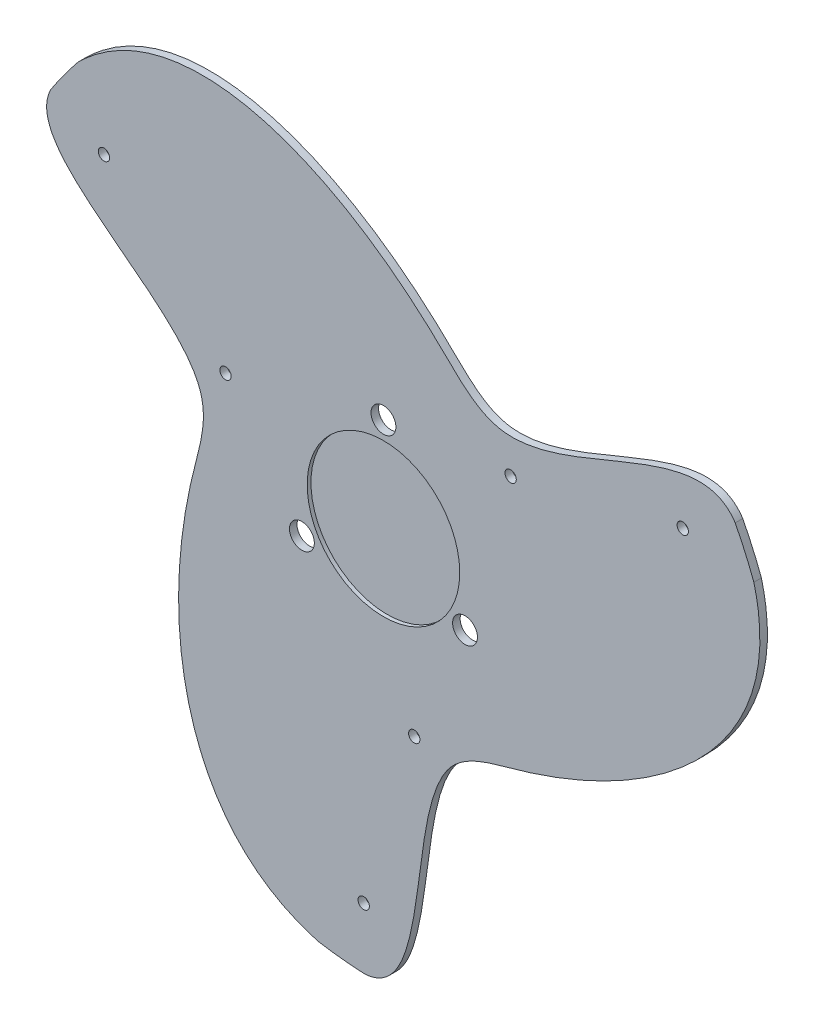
ISO-10303-21;
HEADER;
FILE_DESCRIPTION(('STEP AP214'),'2;1');
FILE_NAME('part.step','',(''),(''),'','','');
FILE_SCHEMA(('AUTOMOTIVE_DESIGN { 1 0 10303 214 1 1 1 1 }'));
ENDSEC;
DATA;
#1=APPLICATION_CONTEXT('core data for automotive mechanical design processes');
#2=APPLICATION_PROTOCOL_DEFINITION('international standard','automotive_design',2000,#1);
#3=PRODUCT_CONTEXT('',#1,'mechanical');
#4=PRODUCT('Part','Part','',(#3));
#5=PRODUCT_RELATED_PRODUCT_CATEGORY('part','',(#4));
#6=PRODUCT_DEFINITION_FORMATION('','',#4);
#7=PRODUCT_DEFINITION_CONTEXT('part definition',#1,'design');
#8=PRODUCT_DEFINITION('design','',#6,#7);
#9=PRODUCT_DEFINITION_SHAPE('','',#8);
#10=(LENGTH_UNIT() NAMED_UNIT(*) SI_UNIT(.MILLI.,.METRE.));
#11=(NAMED_UNIT(*) PLANE_ANGLE_UNIT() SI_UNIT($,.RADIAN.));
#12=(NAMED_UNIT(*) SI_UNIT($,.STERADIAN.) SOLID_ANGLE_UNIT());
#13=UNCERTAINTY_MEASURE_WITH_UNIT(LENGTH_MEASURE(1.E-05),#10,'distance_accuracy_value','');
#14=(GEOMETRIC_REPRESENTATION_CONTEXT(3) GLOBAL_UNCERTAINTY_ASSIGNED_CONTEXT((#13)) GLOBAL_UNIT_ASSIGNED_CONTEXT((#10,
#11,#12)) REPRESENTATION_CONTEXT('',''));
#15=CARTESIAN_POINT('',(0.,0.,0.));
#16=DIRECTION('',(0.,0.,1.));
#17=DIRECTION('',(1.,0.,0.));
#18=AXIS2_PLACEMENT_3D('',#15,#16,#17);
#19=CARTESIAN_POINT('',(0.,0.,2.));
#20=DIRECTION('',(0.,0.,1.));
#21=DIRECTION('',(1.00000000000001,0.,0.));
#22=AXIS2_PLACEMENT_3D('',#19,#20,#21);
#23=PLANE('',#22);
#24=CARTESIAN_POINT('',(-21.6506350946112,-12.4999999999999,2.));
#25=DIRECTION('',(0.,0.,1.));
#26=DIRECTION('',(1.00000000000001,0.,0.));
#27=AXIS2_PLACEMENT_3D('',#24,#25,#26);
#28=CIRCLE('',#27,3.3);
#29=CARTESIAN_POINT('',(-18.3506350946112,-12.4999999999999,2.));
#30=VERTEX_POINT('',#29);
#31=EDGE_CURVE('E114',#30,#30,#28,.T.);
#32=ORIENTED_EDGE('',*,*,#31,.F.);
#33=EDGE_LOOP('',(#32));
#34=FACE_BOUND('',#33,.T.);
#35=CARTESIAN_POINT('',(21.6506350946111,-12.5000000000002,2.));
#36=DIRECTION('',(0.,0.,1.));
#37=DIRECTION('',(1.00000000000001,0.,0.));
#38=AXIS2_PLACEMENT_3D('',#35,#36,#37);
#39=CIRCLE('',#38,3.3);
#40=CARTESIAN_POINT('',(24.9506350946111,-12.5000000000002,2.));
#41=VERTEX_POINT('',#40);
#42=EDGE_CURVE('E278',#41,#41,#39,.T.);
#43=ORIENTED_EDGE('',*,*,#42,.F.);
#44=EDGE_LOOP('',(#43));
#45=FACE_BOUND('',#44,.T.);
#46=CARTESIAN_POINT('',(0.,25.0000000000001,2.));
#47=DIRECTION('',(0.,0.,1.));
#48=DIRECTION('',(1.00000000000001,0.,0.));
#49=AXIS2_PLACEMENT_3D('',#46,#47,#48);
#50=CIRCLE('',#49,3.3);
#51=CARTESIAN_POINT('',(3.30000000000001,25.0000000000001,2.));
#52=VERTEX_POINT('',#51);
#53=EDGE_CURVE('E286',#52,#52,#50,.T.);
#54=ORIENTED_EDGE('',*,*,#53,.F.);
#55=EDGE_LOOP('',(#54));
#56=FACE_BOUND('',#55,.T.);
#57=CARTESIAN_POINT('',(79.4483918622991,39.8074867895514,2.));
#58=DIRECTION('',(0.,0.,1.));
#59=DIRECTION('',(1.00000000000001,0.,0.));
#60=AXIS2_PLACEMENT_3D('',#57,#58,#59);
#61=CIRCLE('',#60,1.50000000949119);
#62=CARTESIAN_POINT('',(80.9483918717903,39.8074867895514,2.));
#63=VERTEX_POINT('',#62);
#64=EDGE_CURVE('E217',#63,#63,#61,.T.);
#65=ORIENTED_EDGE('',*,*,#64,.F.);
#66=EDGE_LOOP('',(#65));
#67=FACE_BOUND('',#66,.T.);
#68=CARTESIAN_POINT('',(-8.20188198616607,-104.679172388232,2.));
#69=CARTESIAN_POINT('',(14.4231182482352,-108.452894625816,2.));
#70=CARTESIAN_POINT('',(1.89457091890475,-45.3386096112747,2.));
#71=CARTESIAN_POINT('',(69.1806372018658,-31.0563703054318,2.));
#72=CARTESIAN_POINT('',(107.713107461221,1.01811318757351,2.));
#73=CARTESIAN_POINT('',(98.3241797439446,36.8423082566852,2.));
#74=B_SPLINE_CURVE_WITH_KNOTS('',3,(#68,#69,#70,#71,#72,#73),.UNSPECIFIED.,.F.,.F.,(4,1,1,4),
(0.,0.296737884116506,0.396737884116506,1.),.UNSPECIFIED.);
#75=CARTESIAN_POINT('',(98.3241797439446,36.8423082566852,2.));
#76=VERTEX_POINT('',#75);
#77=CARTESIAN_POINT('',(-5.09598519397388,-104.87626487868,2.00000000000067));
#78=VERTEX_POINT('',#77);
#79=EDGE_CURVE('E104',#76,#78,#74,.F.);
#80=ORIENTED_EDGE('',*,*,#79,.F.);
#81=CARTESIAN_POINT('',(0.,0.,2.));
#82=DIRECTION('',(0.,0.,1.));
#83=DIRECTION('',(1.00000000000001,0.,0.));
#84=AXIS2_PLACEMENT_3D('',#81,#82,#83);
#85=CIRCLE('',#84,105.);
#86=CARTESIAN_POINT('',(93.3735022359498,48.0248798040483,2.));
#87=VERTEX_POINT('',#86);
#88=EDGE_CURVE('E103',#76,#87,#85,.T.);
#89=ORIENTED_EDGE('',*,*,#88,.T.);
#90=CARTESIAN_POINT('',(94.7557635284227,45.2365480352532,2.));
#91=CARTESIAN_POINT('',(86.7114027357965,66.7172341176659,2.));
#92=CARTESIAN_POINT('',(38.317102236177,24.3100513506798,2.));
#93=CARTESIAN_POINT('',(-7.69471296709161,75.4403744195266,2.00000000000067));
#94=CARTESIAN_POINT('',(-54.7382656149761,92.7732307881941,1.99999999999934));
#95=CARTESIAN_POINT('',(-81.0684647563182,66.7300833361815,2.));
#96=B_SPLINE_CURVE_WITH_KNOTS('',3,(#90,#91,#92,#93,#94,#95),.UNSPECIFIED.,.F.,.F.,(4,1,1,4),
(0.,0.296737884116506,0.396737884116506,1.),.UNSPECIFIED.);
#97=CARTESIAN_POINT('',(-81.0684647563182,66.7300833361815,2.));
#98=VERTEX_POINT('',#97);
#99=EDGE_CURVE('E290',#98,#87,#96,.F.);
#100=ORIENTED_EDGE('',*,*,#99,.F.);
#101=CARTESIAN_POINT('',(-88.2775170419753,56.851385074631,2.));
#102=VERTEX_POINT('',#101);
#103=EDGE_CURVE('E119',#98,#102,#85,.T.);
#104=ORIENTED_EDGE('',*,*,#103,.T.);
#105=CARTESIAN_POINT('',(-86.5538815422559,59.4426243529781,2.00000000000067));
#106=CARTESIAN_POINT('',(-101.134520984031,41.7356605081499,2.00000000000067));
#107=CARTESIAN_POINT('',(-40.2116731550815,21.0285582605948,2.));
#108=CARTESIAN_POINT('',(-61.4859242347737,-44.3840041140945,2.));
#109=CARTESIAN_POINT('',(-52.9748418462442,-93.7913439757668,2.));
#110=CARTESIAN_POINT('',(-17.2557149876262,-103.572391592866,2.));
#111=B_SPLINE_CURVE_WITH_KNOTS('',3,(#105,#106,#107,#108,#109,#110),.UNSPECIFIED.,.F.,.F.,(4,1,
1,4),(0.,0.296737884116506,0.396737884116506,1.),.UNSPECIFIED.);
#112=CARTESIAN_POINT('',(-17.2557149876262,-103.572391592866,2.));
#113=VERTEX_POINT('',#112);
#114=EDGE_CURVE('E208',#113,#102,#111,.F.);
#115=ORIENTED_EDGE('',*,*,#114,.F.);
#116=EDGE_CURVE('E118',#113,#78,#85,.T.);
#117=ORIENTED_EDGE('',*,*,#116,.T.);
#118=EDGE_LOOP('',(#80,#89,#100,#104,#115,#117));
#119=FACE_BOUND('',#118,.T.);
#120=CARTESIAN_POINT('',(-74.1984907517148,48.9005822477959,2.00000000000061));
#121=DIRECTION('',(0.,0.,1.));
#122=DIRECTION('',(-0.500000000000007,0.866025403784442,0.));
#123=AXIS2_PLACEMENT_3D('',#120,#121,#122);
#124=CIRCLE('',#123,1.50000000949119);
#125=CARTESIAN_POINT('',(-74.9484907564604,50.1996203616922,2.00000000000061));
#126=VERTEX_POINT('',#125);
#127=EDGE_CURVE('E171',#126,#126,#124,.T.);
#128=ORIENTED_EDGE('',*,*,#127,.F.);
#129=EDGE_LOOP('',(#128));
#130=FACE_BOUND('',#129,.T.);
#131=CARTESIAN_POINT('',(-5.24990111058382,-88.7080690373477,2.));
#132=DIRECTION('',(0.,0.,1.));
#133=DIRECTION('',(-0.499999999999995,-0.866025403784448,0.));
#134=AXIS2_PLACEMENT_3D('',#131,#132,#133);
#135=CIRCLE('',#134,1.50000000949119);
#136=CARTESIAN_POINT('',(-5.99990111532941,-90.007107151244,2.));
#137=VERTEX_POINT('',#136);
#138=EDGE_CURVE('E146',#137,#137,#135,.T.);
#139=ORIENTED_EDGE('',*,*,#138,.F.);
#140=EDGE_LOOP('',(#139));
#141=FACE_BOUND('',#140,.T.);
#142=CARTESIAN_POINT('',(33.7554193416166,28.9240992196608,2.00000000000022));
#143=DIRECTION('',(0.,0.,1.));
#144=DIRECTION('',(1.00000000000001,0.,0.));
#145=AXIS2_PLACEMENT_3D('',#142,#143,#144);
#146=CIRCLE('',#145,1.49999999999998);
#147=CARTESIAN_POINT('',(35.2554193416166,28.9240992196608,2.00000000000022));
#148=VERTEX_POINT('',#147);
#149=EDGE_CURVE('E147',#148,#148,#146,.T.);
#150=ORIENTED_EDGE('',*,*,#149,.F.);
#151=EDGE_LOOP('',(#150));
#152=FACE_BOUND('',#151,.T.);
#153=CARTESIAN_POINT('',(-41.9267143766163,14.771001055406,2.00000000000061));
#154=DIRECTION('',(0.,0.,1.));
#155=DIRECTION('',(-0.500000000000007,0.866025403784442,0.));
#156=AXIS2_PLACEMENT_3D('',#153,#154,#155);
#157=CIRCLE('',#156,1.49999999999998);
#158=CARTESIAN_POINT('',(-42.6767143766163,16.0700391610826,2.00000000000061));
#159=VERTEX_POINT('',#158);
#160=EDGE_CURVE('E150',#159,#159,#157,.T.);
#161=ORIENTED_EDGE('',*,*,#160,.F.);
#162=EDGE_LOOP('',(#161));
#163=FACE_BOUND('',#162,.T.);
#164=CARTESIAN_POINT('',(8.17129503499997,-43.6951002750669,2.));
#165=DIRECTION('',(0.,0.,1.));
#166=DIRECTION('',(-0.499999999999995,-0.866025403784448,0.));
#167=AXIS2_PLACEMENT_3D('',#164,#165,#166);
#168=CIRCLE('',#167,1.49999999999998);
#169=CARTESIAN_POINT('',(7.42129503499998,-44.9941383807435,2.));
#170=VERTEX_POINT('',#169);
#171=EDGE_CURVE('E153',#170,#170,#168,.T.);
#172=ORIENTED_EDGE('',*,*,#171,.F.);
#173=EDGE_LOOP('',(#172));
#174=FACE_BOUND('',#173,.T.);
#175=CARTESIAN_POINT('',(0.,0.,2.));
#176=DIRECTION('',(0.,0.,1.));
#177=DIRECTION('',(1.00000000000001,0.,0.));
#178=AXIS2_PLACEMENT_3D('',#175,#176,#177);
#179=CIRCLE('',#178,20.25);
#180=CARTESIAN_POINT('',(20.2500000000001,0.,2.));
#181=VERTEX_POINT('',#180);
#182=EDGE_CURVE('E38',#181,#181,#179,.F.);
#183=ORIENTED_EDGE('',*,*,#182,.T.);
#184=EDGE_LOOP('',(#183));
#185=FACE_BOUND('',#184,.T.);
#186=ADVANCED_FACE('F34',(#34,#45,#56,#67,#119,#130,#141,#152,#163,#174,#185),#23,.T.);
#187=CARTESIAN_POINT('',(0.,0.,2.));
#188=DIRECTION('',(0.,0.,-1.));
#189=DIRECTION('',(-1.00000000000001,0.,0.));
#190=AXIS2_PLACEMENT_3D('',#187,#188,#189);
#191=CYLINDRICAL_SURFACE('',#190,105.);
#192=CARTESIAN_POINT('',(0.,0.,0.));
#193=DIRECTION('',(0.,0.,1.));
#194=DIRECTION('',(1.00000000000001,0.,0.));
#195=AXIS2_PLACEMENT_3D('',#192,#193,#194);
#196=CIRCLE('',#195,105.);
#197=CARTESIAN_POINT('',(-17.2557149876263,-103.572391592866,0.));
#198=VERTEX_POINT('',#197);
#199=CARTESIAN_POINT('',(-5.0959851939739,-104.876264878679,6.66133814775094E-13));
#200=VERTEX_POINT('',#199);
#201=EDGE_CURVE('E51',#198,#200,#196,.T.);
#202=ORIENTED_EDGE('',*,*,#201,.T.);
#203=DIRECTION('',(0.,0.,-1.));
#204=VECTOR('',#203,1.);
#205=CARTESIAN_POINT('',(-5.09598519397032,-104.87626487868,10.0000000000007));
#206=LINE('',#205,#204);
#207=EDGE_CURVE('E95',#200,#78,#206,.F.);
#208=ORIENTED_EDGE('',*,*,#207,.T.);
#209=ORIENTED_EDGE('',*,*,#116,.F.);
#210=DIRECTION('',(0.,0.,-1.));
#211=VECTOR('',#210,1.);
#212=CARTESIAN_POINT('',(-17.2557149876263,-103.572391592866,10.));
#213=LINE('',#212,#211);
#214=EDGE_CURVE('E203',#113,#198,#213,.T.);
#215=ORIENTED_EDGE('',*,*,#214,.T.);
#216=EDGE_LOOP('',(#202,#208,#209,#215));
#217=FACE_BOUND('',#216,.T.);
#218=ADVANCED_FACE('F249',(#217),#191,.T.);
#219=CARTESIAN_POINT('',(-81.0684647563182,66.7300833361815,0.));
#220=VERTEX_POINT('',#219);
#221=CARTESIAN_POINT('',(-88.277517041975,56.8513850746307,0.));
#222=VERTEX_POINT('',#221);
#223=EDGE_CURVE('E59',#220,#222,#196,.T.);
#224=ORIENTED_EDGE('',*,*,#223,.T.);
#225=DIRECTION('',(0.,0.,-1.));
#226=VECTOR('',#225,1.);
#227=CARTESIAN_POINT('',(-88.2775170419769,56.8513850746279,10.));
#228=LINE('',#227,#226);
#229=EDGE_CURVE('E212',#222,#102,#228,.F.);
#230=ORIENTED_EDGE('',*,*,#229,.T.);
#231=ORIENTED_EDGE('',*,*,#103,.F.);
#232=DIRECTION('',(0.,0.,-1.));
#233=VECTOR('',#232,1.);
#234=CARTESIAN_POINT('',(-81.0684647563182,66.7300833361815,9.99999999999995));
#235=LINE('',#234,#233);
#236=EDGE_CURVE('E221',#98,#220,#235,.T.);
#237=ORIENTED_EDGE('',*,*,#236,.T.);
#238=EDGE_LOOP('',(#224,#230,#231,#237));
#239=FACE_BOUND('',#238,.T.);
#240=ADVANCED_FACE('F255',(#239),#191,.T.);
#241=ORIENTED_EDGE('',*,*,#88,.F.);
#242=DIRECTION('',(0.,0.,-1.));
#243=VECTOR('',#242,1.);
#244=CARTESIAN_POINT('',(98.3241797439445,36.8423082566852,10.));
#245=LINE('',#244,#243);
#246=CARTESIAN_POINT('',(98.3241797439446,36.8423082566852,0.));
#247=VERTEX_POINT('',#246);
#248=EDGE_CURVE('E93',#76,#247,#245,.T.);
#249=ORIENTED_EDGE('',*,*,#248,.T.);
#250=CARTESIAN_POINT('',(93.3735022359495,48.0248798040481,0.));
#251=VERTEX_POINT('',#250);
#252=EDGE_CURVE('E101',#247,#251,#196,.T.);
#253=ORIENTED_EDGE('',*,*,#252,.T.);
#254=DIRECTION('',(0.,0.,-1.));
#255=VECTOR('',#254,1.);
#256=CARTESIAN_POINT('',(93.373502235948,48.024879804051,10.));
#257=LINE('',#256,#255);
#258=EDGE_CURVE('E289',#251,#87,#257,.F.);
#259=ORIENTED_EDGE('',*,*,#258,.T.);
#260=EDGE_LOOP('',(#241,#249,#253,#259));
#261=FACE_BOUND('',#260,.T.);
#262=ADVANCED_FACE('F36',(#261),#191,.T.);
#263=CARTESIAN_POINT('',(0.,0.,0.));
#264=DIRECTION('',(0.,0.,1.));
#265=DIRECTION('',(1.00000000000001,0.,0.));
#266=AXIS2_PLACEMENT_3D('',#263,#264,#265);
#267=PLANE('',#266);
#268=CARTESIAN_POINT('',(8.17129503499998,-43.6951002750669,0.));
#269=DIRECTION('',(0.,0.,1.));
#270=DIRECTION('',(1.00000000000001,0.,0.));
#271=AXIS2_PLACEMENT_3D('',#268,#269,#270);
#272=CIRCLE('',#271,1.49999999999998);
#273=CARTESIAN_POINT('',(9.67129503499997,-43.6951002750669,0.));
#274=VERTEX_POINT('',#273);
#275=EDGE_CURVE('E151',#274,#274,#272,.T.);
#276=ORIENTED_EDGE('',*,*,#275,.T.);
#277=EDGE_LOOP('',(#276));
#278=FACE_BOUND('',#277,.T.);
#279=CARTESIAN_POINT('',(-41.9267143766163,14.771001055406,6.66133814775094E-13));
#280=DIRECTION('',(0.,0.,1.));
#281=DIRECTION('',(1.00000000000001,0.,0.));
#282=AXIS2_PLACEMENT_3D('',#279,#280,#281);
#283=CIRCLE('',#282,1.49999999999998);
#284=CARTESIAN_POINT('',(-40.4267143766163,14.771001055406,6.66133814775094E-13));
#285=VERTEX_POINT('',#284);
#286=EDGE_CURVE('E148',#285,#285,#283,.T.);
#287=ORIENTED_EDGE('',*,*,#286,.T.);
#288=EDGE_LOOP('',(#287));
#289=FACE_BOUND('',#288,.T.);
#290=CARTESIAN_POINT('',(33.7554193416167,28.9240992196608,6.66133814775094E-13));
#291=DIRECTION('',(0.,0.,1.));
#292=DIRECTION('',(1.00000000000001,0.,0.));
#293=AXIS2_PLACEMENT_3D('',#290,#291,#292);
#294=CIRCLE('',#293,1.49999999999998);
#295=CARTESIAN_POINT('',(35.2554193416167,28.9240992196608,6.66133814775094E-13));
#296=VERTEX_POINT('',#295);
#297=EDGE_CURVE('E140',#296,#296,#294,.T.);
#298=ORIENTED_EDGE('',*,*,#297,.T.);
#299=EDGE_LOOP('',(#298));
#300=FACE_BOUND('',#299,.T.);
#301=CARTESIAN_POINT('',(-5.24990111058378,-88.7080690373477,0.));
#302=DIRECTION('',(0.,0.,1.));
#303=DIRECTION('',(-0.499999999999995,-0.866025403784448,0.));
#304=AXIS2_PLACEMENT_3D('',#301,#302,#303);
#305=CIRCLE('',#304,1.50000000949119);
#306=CARTESIAN_POINT('',(-5.99990111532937,-90.0071071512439,0.));
#307=VERTEX_POINT('',#306);
#308=EDGE_CURVE('E168',#307,#307,#305,.T.);
#309=ORIENTED_EDGE('',*,*,#308,.T.);
#310=EDGE_LOOP('',(#309));
#311=FACE_BOUND('',#310,.T.);
#312=CARTESIAN_POINT('',(-74.1984907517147,48.9005822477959,6.66133814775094E-13));
#313=DIRECTION('',(0.,0.,1.));
#314=DIRECTION('',(-0.500000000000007,0.866025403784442,0.));
#315=AXIS2_PLACEMENT_3D('',#312,#313,#314);
#316=CIRCLE('',#315,1.50000000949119);
#317=CARTESIAN_POINT('',(-74.9484907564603,50.1996203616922,6.66133814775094E-13));
#318=VERTEX_POINT('',#317);
#319=EDGE_CURVE('E105',#318,#318,#316,.T.);
#320=ORIENTED_EDGE('',*,*,#319,.T.);
#321=EDGE_LOOP('',(#320));
#322=FACE_BOUND('',#321,.T.);
#323=CARTESIAN_POINT('',(79.4483918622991,39.8074867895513,0.));
#324=DIRECTION('',(0.,0.,1.));
#325=DIRECTION('',(1.00000000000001,0.,0.));
#326=AXIS2_PLACEMENT_3D('',#323,#324,#325);
#327=CIRCLE('',#326,1.50000000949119);
#328=CARTESIAN_POINT('',(80.9483918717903,39.8074867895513,0.));
#329=VERTEX_POINT('',#328);
#330=EDGE_CURVE('E218',#329,#329,#327,.T.);
#331=ORIENTED_EDGE('',*,*,#330,.T.);
#332=EDGE_LOOP('',(#331));
#333=FACE_BOUND('',#332,.T.);
#334=CARTESIAN_POINT('',(0.,25.0000000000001,0.));
#335=DIRECTION('',(0.,0.,1.));
#336=DIRECTION('',(1.00000000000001,0.,0.));
#337=AXIS2_PLACEMENT_3D('',#334,#335,#336);
#338=CIRCLE('',#337,3.3);
#339=CARTESIAN_POINT('',(3.30000000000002,25.0000000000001,0.));
#340=VERTEX_POINT('',#339);
#341=EDGE_CURVE('E270',#340,#340,#338,.T.);
#342=ORIENTED_EDGE('',*,*,#341,.T.);
#343=EDGE_LOOP('',(#342));
#344=FACE_BOUND('',#343,.T.);
#345=CARTESIAN_POINT('',(21.6506350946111,-12.5000000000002,0.));
#346=DIRECTION('',(0.,0.,1.));
#347=DIRECTION('',(1.00000000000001,0.,0.));
#348=AXIS2_PLACEMENT_3D('',#345,#346,#347);
#349=CIRCLE('',#348,3.3);
#350=CARTESIAN_POINT('',(24.9506350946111,-12.5000000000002,0.));
#351=VERTEX_POINT('',#350);
#352=EDGE_CURVE('E274',#351,#351,#349,.T.);
#353=ORIENTED_EDGE('',*,*,#352,.T.);
#354=EDGE_LOOP('',(#353));
#355=FACE_BOUND('',#354,.T.);
#356=CARTESIAN_POINT('',(-21.6506350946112,-12.4999999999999,0.));
#357=DIRECTION('',(0.,0.,1.));
#358=DIRECTION('',(1.00000000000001,0.,0.));
#359=AXIS2_PLACEMENT_3D('',#356,#357,#358);
#360=CIRCLE('',#359,3.3);
#361=CARTESIAN_POINT('',(-18.3506350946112,-12.4999999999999,0.));
#362=VERTEX_POINT('',#361);
#363=EDGE_CURVE('E111',#362,#362,#360,.T.);
#364=ORIENTED_EDGE('',*,*,#363,.T.);
#365=EDGE_LOOP('',(#364));
#366=FACE_BOUND('',#365,.T.);
#367=ORIENTED_EDGE('',*,*,#252,.F.);
#368=CARTESIAN_POINT('',(-8.20188198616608,-104.679172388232,0.));
#369=CARTESIAN_POINT('',(14.4231182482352,-108.452894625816,0.));
#370=CARTESIAN_POINT('',(1.89457091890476,-45.3386096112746,0.));
#371=CARTESIAN_POINT('',(69.1806372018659,-31.0563703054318,0.));
#372=CARTESIAN_POINT('',(107.713107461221,1.01811318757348,0.));
#373=CARTESIAN_POINT('',(98.3241797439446,36.8423082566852,0.));
#374=B_SPLINE_CURVE_WITH_KNOTS('',3,(#368,#369,#370,#371,#372,#373),.UNSPECIFIED.,.F.,.F.,(4,1,
1,4),(0.,0.296737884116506,0.396737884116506,1.),.UNSPECIFIED.);
#375=EDGE_CURVE('E11',#247,#200,#374,.F.);
#376=ORIENTED_EDGE('',*,*,#375,.T.);
#377=ORIENTED_EDGE('',*,*,#201,.F.);
#378=CARTESIAN_POINT('',(-86.5538815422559,59.4426243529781,6.66133814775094E-13));
#379=CARTESIAN_POINT('',(-101.134520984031,41.7356605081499,6.66133814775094E-13));
#380=CARTESIAN_POINT('',(-40.2116731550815,21.0285582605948,0.));
#381=CARTESIAN_POINT('',(-61.4859242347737,-44.3840041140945,0.));
#382=CARTESIAN_POINT('',(-52.9748418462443,-93.7913439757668,0.));
#383=CARTESIAN_POINT('',(-17.2557149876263,-103.572391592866,0.));
#384=B_SPLINE_CURVE_WITH_KNOTS('',3,(#378,#379,#380,#381,#382,#383),.UNSPECIFIED.,.F.,.F.,(4,1,
1,4),(0.,0.296737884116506,0.396737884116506,1.),.UNSPECIFIED.);
#385=EDGE_CURVE('E43',#198,#222,#384,.F.);
#386=ORIENTED_EDGE('',*,*,#385,.T.);
#387=ORIENTED_EDGE('',*,*,#223,.F.);
#388=CARTESIAN_POINT('',(94.7557635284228,45.2365480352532,0.));
#389=CARTESIAN_POINT('',(86.7114027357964,66.7172341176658,0.));
#390=CARTESIAN_POINT('',(38.317102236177,24.3100513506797,0.));
#391=CARTESIAN_POINT('',(-7.69471296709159,75.4403744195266,6.66133814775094E-13));
#392=CARTESIAN_POINT('',(-54.7382656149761,92.7732307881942,-6.66133814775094E-13));
#393=CARTESIAN_POINT('',(-81.0684647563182,66.7300833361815,0.));
#394=B_SPLINE_CURVE_WITH_KNOTS('',3,(#388,#389,#390,#391,#392,#393),.UNSPECIFIED.,.F.,.F.,(4,1,
1,4),(0.,0.296737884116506,0.396737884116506,1.),.UNSPECIFIED.);
#395=EDGE_CURVE('E110',#220,#251,#394,.F.);
#396=ORIENTED_EDGE('',*,*,#395,.T.);
#397=EDGE_LOOP('',(#367,#376,#377,#386,#387,#396));
#398=FACE_BOUND('',#397,.T.);
#399=ADVANCED_FACE('F108',(#278,#289,#300,#311,#322,#333,#344,#355,#366,#398),#267,.F.);
#400=CARTESIAN_POINT('',(-21.6506350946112,-12.4999999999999,2.));
#401=DIRECTION('',(0.,0.,1.));
#402=DIRECTION('',(1.00000000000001,0.,0.));
#403=AXIS2_PLACEMENT_3D('',#400,#401,#402);
#404=CYLINDRICAL_SURFACE('',#403,3.3);
#405=ORIENTED_EDGE('',*,*,#31,.T.);
#406=EDGE_LOOP('',(#405));
#407=FACE_BOUND('',#406,.T.);
#408=ORIENTED_EDGE('',*,*,#363,.F.);
#409=EDGE_LOOP('',(#408));
#410=FACE_BOUND('',#409,.T.);
#411=ADVANCED_FACE('F243',(#407,#410),#404,.F.);
#412=CARTESIAN_POINT('',(21.6506350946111,-12.5000000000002,2.));
#413=DIRECTION('',(0.,0.,1.));
#414=DIRECTION('',(1.00000000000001,0.,0.));
#415=AXIS2_PLACEMENT_3D('',#412,#413,#414);
#416=CYLINDRICAL_SURFACE('',#415,3.3);
#417=ORIENTED_EDGE('',*,*,#42,.T.);
#418=EDGE_LOOP('',(#417));
#419=FACE_BOUND('',#418,.T.);
#420=ORIENTED_EDGE('',*,*,#352,.F.);
#421=EDGE_LOOP('',(#420));
#422=FACE_BOUND('',#421,.T.);
#423=ADVANCED_FACE('F239',(#419,#422),#416,.F.);
#424=CARTESIAN_POINT('',(0.,25.0000000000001,2.));
#425=DIRECTION('',(0.,0.,1.));
#426=DIRECTION('',(1.00000000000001,0.,0.));
#427=AXIS2_PLACEMENT_3D('',#424,#425,#426);
#428=CYLINDRICAL_SURFACE('',#427,3.3);
#429=ORIENTED_EDGE('',*,*,#53,.T.);
#430=EDGE_LOOP('',(#429));
#431=FACE_BOUND('',#430,.T.);
#432=ORIENTED_EDGE('',*,*,#341,.F.);
#433=EDGE_LOOP('',(#432));
#434=FACE_BOUND('',#433,.T.);
#435=ADVANCED_FACE('F235',(#431,#434),#428,.F.);
#436=CARTESIAN_POINT('',(94.7557635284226,45.2365480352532,10.));
#437=CARTESIAN_POINT('',(86.7114027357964,66.7172341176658,10.));
#438=CARTESIAN_POINT('',(38.317102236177,24.3100513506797,10.));
#439=CARTESIAN_POINT('',(-7.69471296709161,75.4403744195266,10.0000000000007));
#440=CARTESIAN_POINT('',(-54.7382656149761,92.7732307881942,9.99999999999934));
#441=CARTESIAN_POINT('',(-81.0684647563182,66.7300833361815,9.99999999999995));
#442=B_SPLINE_CURVE_WITH_KNOTS('',3,(#436,#437,#438,#439,#440,#441),.UNSPECIFIED.,.F.,.F.,(4,1,
1,4),(0.,0.296737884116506,0.396737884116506,1.),.UNSPECIFIED.);
#443=DIRECTION('',(0.,0.,-1.));
#444=VECTOR('',#443,1.);
#445=SURFACE_OF_LINEAR_EXTRUSION('',#442,#444);
#446=ORIENTED_EDGE('',*,*,#395,.F.);
#447=ORIENTED_EDGE('',*,*,#236,.F.);
#448=ORIENTED_EDGE('',*,*,#99,.T.);
#449=ORIENTED_EDGE('',*,*,#258,.F.);
#450=EDGE_LOOP('',(#446,#447,#448,#449));
#451=FACE_BOUND('',#450,.T.);
#452=ADVANCED_FACE('F232',(#451),#445,.F.);
#453=CARTESIAN_POINT('',(79.4483918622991,39.8074867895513,0.));
#454=DIRECTION('',(0.,0.,1.));
#455=DIRECTION('',(1.00000000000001,0.,0.));
#456=AXIS2_PLACEMENT_3D('',#453,#454,#455);
#457=CYLINDRICAL_SURFACE('',#456,1.50000000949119);
#458=ORIENTED_EDGE('',*,*,#330,.F.);
#459=EDGE_LOOP('',(#458));
#460=FACE_BOUND('',#459,.T.);
#461=ORIENTED_EDGE('',*,*,#64,.T.);
#462=EDGE_LOOP('',(#461));
#463=FACE_BOUND('',#462,.T.);
#464=ADVANCED_FACE('F195',(#460,#463),#457,.F.);
#465=CARTESIAN_POINT('',(-86.553881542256,59.4426243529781,10.0000000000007));
#466=CARTESIAN_POINT('',(-101.134520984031,41.7356605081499,10.0000000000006));
#467=CARTESIAN_POINT('',(-40.2116731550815,21.0285582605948,10.));
#468=CARTESIAN_POINT('',(-61.4859242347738,-44.3840041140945,10.));
#469=CARTESIAN_POINT('',(-52.9748418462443,-93.7913439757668,10.));
#470=CARTESIAN_POINT('',(-17.2557149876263,-103.572391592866,10.));
#471=B_SPLINE_CURVE_WITH_KNOTS('',3,(#465,#466,#467,#468,#469,#470),.UNSPECIFIED.,.F.,.F.,(4,1,
1,4),(0.,0.296737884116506,0.396737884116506,1.),.UNSPECIFIED.);
#472=DIRECTION('',(0.,0.,-1.));
#473=VECTOR('',#472,1.);
#474=SURFACE_OF_LINEAR_EXTRUSION('',#471,#473);
#475=ORIENTED_EDGE('',*,*,#385,.F.);
#476=ORIENTED_EDGE('',*,*,#214,.F.);
#477=ORIENTED_EDGE('',*,*,#114,.T.);
#478=ORIENTED_EDGE('',*,*,#229,.F.);
#479=EDGE_LOOP('',(#475,#476,#477,#478));
#480=FACE_BOUND('',#479,.T.);
#481=ADVANCED_FACE('F190',(#480),#474,.F.);
#482=CARTESIAN_POINT('',(-8.20188198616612,-104.679172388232,10.));
#483=CARTESIAN_POINT('',(14.4231182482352,-108.452894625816,10.));
#484=CARTESIAN_POINT('',(1.89457091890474,-45.3386096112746,10.));
#485=CARTESIAN_POINT('',(69.1806372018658,-31.0563703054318,9.99999999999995));
#486=CARTESIAN_POINT('',(107.713107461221,1.01811318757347,10.));
#487=CARTESIAN_POINT('',(98.3241797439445,36.8423082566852,10.));
#488=B_SPLINE_CURVE_WITH_KNOTS('',3,(#482,#483,#484,#485,#486,#487),.UNSPECIFIED.,.F.,.F.,(4,1,
1,4),(0.,0.296737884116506,0.396737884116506,1.),.UNSPECIFIED.);
#489=DIRECTION('',(0.,0.,-1.));
#490=VECTOR('',#489,1.);
#491=SURFACE_OF_LINEAR_EXTRUSION('',#488,#490);
#492=ORIENTED_EDGE('',*,*,#375,.F.);
#493=ORIENTED_EDGE('',*,*,#248,.F.);
#494=ORIENTED_EDGE('',*,*,#79,.T.);
#495=ORIENTED_EDGE('',*,*,#207,.F.);
#496=EDGE_LOOP('',(#492,#493,#494,#495));
#497=FACE_BOUND('',#496,.T.);
#498=ADVANCED_FACE('F91',(#497),#491,.F.);
#499=CARTESIAN_POINT('',(-74.1984907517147,48.9005822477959,6.66133814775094E-13));
#500=DIRECTION('',(0.,0.,1.));
#501=DIRECTION('',(1.00000000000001,0.,0.));
#502=AXIS2_PLACEMENT_3D('',#499,#500,#501);
#503=CYLINDRICAL_SURFACE('',#502,1.50000000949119);
#504=ORIENTED_EDGE('',*,*,#319,.F.);
#505=EDGE_LOOP('',(#504));
#506=FACE_BOUND('',#505,.T.);
#507=ORIENTED_EDGE('',*,*,#127,.T.);
#508=EDGE_LOOP('',(#507));
#509=FACE_BOUND('',#508,.T.);
#510=ADVANCED_FACE('F189',(#506,#509),#503,.F.);
#511=CARTESIAN_POINT('',(-5.24990111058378,-88.7080690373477,0.));
#512=DIRECTION('',(0.,0.,1.));
#513=DIRECTION('',(1.00000000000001,0.,0.));
#514=AXIS2_PLACEMENT_3D('',#511,#512,#513);
#515=CYLINDRICAL_SURFACE('',#514,1.50000000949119);
#516=ORIENTED_EDGE('',*,*,#308,.F.);
#517=EDGE_LOOP('',(#516));
#518=FACE_BOUND('',#517,.T.);
#519=ORIENTED_EDGE('',*,*,#138,.T.);
#520=EDGE_LOOP('',(#519));
#521=FACE_BOUND('',#520,.T.);
#522=ADVANCED_FACE('F331',(#518,#521),#515,.F.);
#523=CARTESIAN_POINT('',(33.7554193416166,28.9240992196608,-0.999999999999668));
#524=DIRECTION('',(0.,0.,1.));
#525=DIRECTION('',(1.00000000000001,0.,0.));
#526=AXIS2_PLACEMENT_3D('',#523,#524,#525);
#527=CYLINDRICAL_SURFACE('',#526,1.49999999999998);
#528=ORIENTED_EDGE('',*,*,#149,.T.);
#529=EDGE_LOOP('',(#528));
#530=FACE_BOUND('',#529,.T.);
#531=ORIENTED_EDGE('',*,*,#297,.F.);
#532=EDGE_LOOP('',(#531));
#533=FACE_BOUND('',#532,.T.);
#534=ADVANCED_FACE('F328',(#530,#533),#527,.F.);
#535=CARTESIAN_POINT('',(-41.9267143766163,14.771001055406,-0.999999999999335));
#536=DIRECTION('',(0.,0.,1.));
#537=DIRECTION('',(1.00000000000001,0.,0.));
#538=AXIS2_PLACEMENT_3D('',#535,#536,#537);
#539=CYLINDRICAL_SURFACE('',#538,1.49999999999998);
#540=ORIENTED_EDGE('',*,*,#160,.T.);
#541=EDGE_LOOP('',(#540));
#542=FACE_BOUND('',#541,.T.);
#543=ORIENTED_EDGE('',*,*,#286,.F.);
#544=EDGE_LOOP('',(#543));
#545=FACE_BOUND('',#544,.T.);
#546=ADVANCED_FACE('F325',(#542,#545),#539,.F.);
#547=CARTESIAN_POINT('',(8.17129503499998,-43.6951002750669,-1.));
#548=DIRECTION('',(0.,0.,1.));
#549=DIRECTION('',(1.00000000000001,0.,0.));
#550=AXIS2_PLACEMENT_3D('',#547,#548,#549);
#551=CYLINDRICAL_SURFACE('',#550,1.49999999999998);
#552=ORIENTED_EDGE('',*,*,#171,.T.);
#553=EDGE_LOOP('',(#552));
#554=FACE_BOUND('',#553,.T.);
#555=ORIENTED_EDGE('',*,*,#275,.F.);
#556=EDGE_LOOP('',(#555));
#557=FACE_BOUND('',#556,.T.);
#558=ADVANCED_FACE('F313',(#554,#557),#551,.F.);
#559=CARTESIAN_POINT('',(0.,0.,12.));
#560=DIRECTION('',(0.,0.,-1.));
#561=DIRECTION('',(-1.00000000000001,0.,0.));
#562=AXIS2_PLACEMENT_3D('',#559,#560,#561);
#563=CYLINDRICAL_SURFACE('',#562,20.25);
#564=ORIENTED_EDGE('',*,*,#182,.F.);
#565=EDGE_LOOP('',(#564));
#566=FACE_BOUND('',#565,.T.);
#567=CARTESIAN_POINT('',(0.,0.,1.));
#568=DIRECTION('',(0.,0.,1.));
#569=DIRECTION('',(1.00000000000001,0.,0.));
#570=AXIS2_PLACEMENT_3D('',#567,#568,#569);
#571=CIRCLE('',#570,20.25);
#572=CARTESIAN_POINT('',(20.2500000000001,0.,1.));
#573=VERTEX_POINT('',#572);
#574=EDGE_CURVE('E163',#573,#573,#571,.T.);
#575=ORIENTED_EDGE('',*,*,#574,.F.);
#576=EDGE_LOOP('',(#575));
#577=FACE_BOUND('',#576,.T.);
#578=ADVANCED_FACE('F309',(#566,#577),#563,.F.);
#579=CARTESIAN_POINT('',(0.,0.,1.));
#580=DIRECTION('',(0.,0.,1.));
#581=DIRECTION('',(1.00000000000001,0.,0.));
#582=AXIS2_PLACEMENT_3D('',#579,#580,#581);
#583=PLANE('',#582);
#584=ORIENTED_EDGE('',*,*,#574,.T.);
#585=EDGE_LOOP('',(#584));
#586=FACE_BOUND('',#585,.T.);
#587=ADVANCED_FACE('F312',(#586),#583,.T.);
#588=CLOSED_SHELL('',(#186,#218,#240,#262,#399,#411,#423,#435,#452,#464,#481,#498,#510,#522,
#534,#546,#558,#578,#587));
#589=MANIFOLD_SOLID_BREP('B2',#588);
#590=ADVANCED_BREP_SHAPE_REPRESENTATION('',(#18,#589),#14);
#591=SHAPE_DEFINITION_REPRESENTATION(#9,#590);
ENDSEC;
END-ISO-10303-21;
